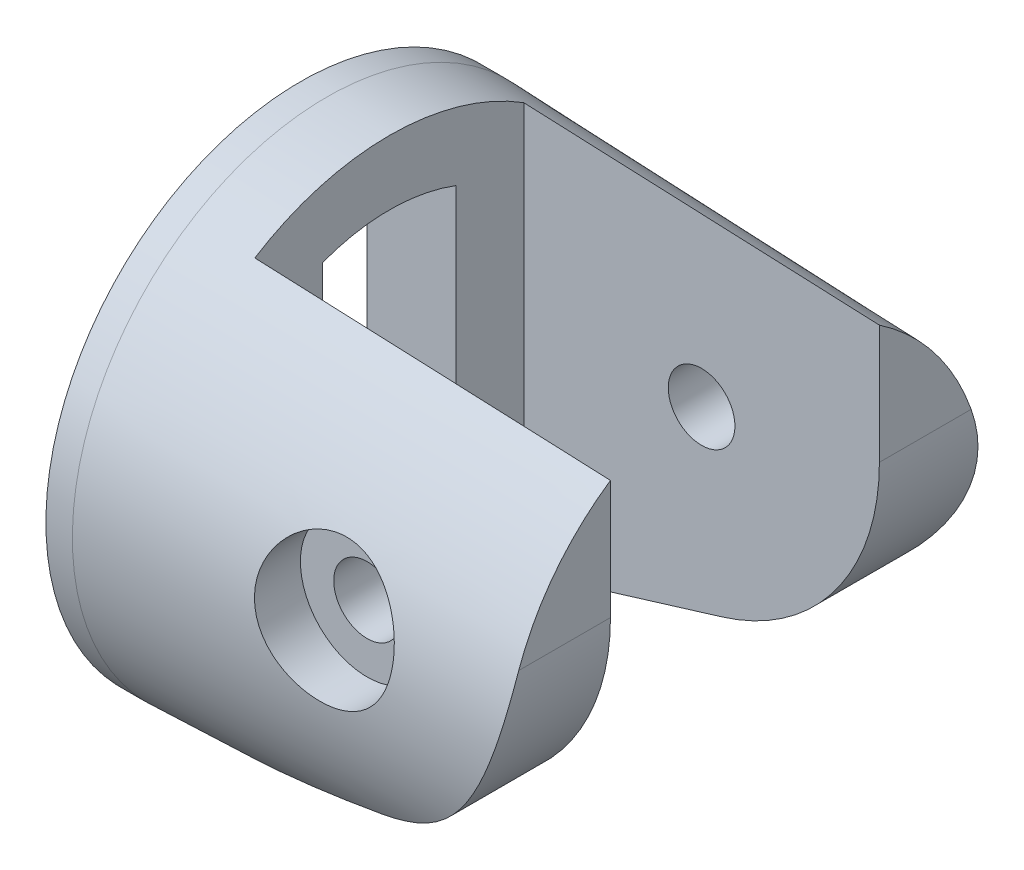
ISO-10303-21;
HEADER;
FILE_DESCRIPTION(('STEP AP214'),'2;1');
FILE_NAME('part.step','',(''),(''),'','','');
FILE_SCHEMA(('AUTOMOTIVE_DESIGN { 1 0 10303 214 1 1 1 1 }'));
ENDSEC;
DATA;
#1=APPLICATION_CONTEXT('core data for automotive mechanical design processes');
#2=APPLICATION_PROTOCOL_DEFINITION('international standard','automotive_design',2000,#1);
#3=PRODUCT_CONTEXT('',#1,'mechanical');
#4=PRODUCT('Part','Part','',(#3));
#5=PRODUCT_RELATED_PRODUCT_CATEGORY('part','',(#4));
#6=PRODUCT_DEFINITION_FORMATION('','',#4);
#7=PRODUCT_DEFINITION_CONTEXT('part definition',#1,'design');
#8=PRODUCT_DEFINITION('design','',#6,#7);
#9=PRODUCT_DEFINITION_SHAPE('','',#8);
#10=(LENGTH_UNIT() NAMED_UNIT(*) SI_UNIT(.MILLI.,.METRE.));
#11=(NAMED_UNIT(*) PLANE_ANGLE_UNIT() SI_UNIT($,.RADIAN.));
#12=(NAMED_UNIT(*) SI_UNIT($,.STERADIAN.) SOLID_ANGLE_UNIT());
#13=UNCERTAINTY_MEASURE_WITH_UNIT(LENGTH_MEASURE(1.E-05),#10,'distance_accuracy_value','');
#14=(GEOMETRIC_REPRESENTATION_CONTEXT(3) GLOBAL_UNCERTAINTY_ASSIGNED_CONTEXT((#13)) GLOBAL_UNIT_ASSIGNED_CONTEXT((#10,
#11,#12)) REPRESENTATION_CONTEXT('',''));
#15=CARTESIAN_POINT('',(0.,0.,0.));
#16=DIRECTION('',(0.,0.,1.));
#17=DIRECTION('',(1.,0.,0.));
#18=AXIS2_PLACEMENT_3D('',#15,#16,#17);
#19=CARTESIAN_POINT('',(20.,0.,0.));
#20=DIRECTION('',(-1.,0.,0.));
#21=DIRECTION('',(0.,0.,1.));
#22=AXIS2_PLACEMENT_3D('',#19,#20,#21);
#23=CYLINDRICAL_SURFACE('',#22,11.45);
#24=CARTESIAN_POINT('',(0.,0.,0.));
#25=DIRECTION('',(-1.,0.,0.));
#26=DIRECTION('',(0.,0.,1.));
#27=AXIS2_PLACEMENT_3D('',#24,#25,#26);
#28=CIRCLE('',#27,11.45);
#29=CARTESIAN_POINT('',(0.,-9.92134659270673,5.71571358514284));
#30=VERTEX_POINT('',#29);
#31=CARTESIAN_POINT('',(0.,-9.92134659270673,-5.71571358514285));
#32=VERTEX_POINT('',#31);
#33=EDGE_CURVE('E49',#30,#32,#28,.T.);
#34=ORIENTED_EDGE('',*,*,#33,.F.);
#35=CARTESIAN_POINT('',(32.4512624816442,0.,0.));
#36=DIRECTION('',(-0.292371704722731,0.956304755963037,0.));
#37=DIRECTION('',(-0.956304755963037,-0.292371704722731,0.));
#38=AXIS2_PLACEMENT_3D('',#35,#36,#37);
#39=ELLIPSE('',#38,39.1624764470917,11.45);
#40=CARTESIAN_POINT('',(1.19109025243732,-9.55719375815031,6.30575510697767));
#41=VERTEX_POINT('',#40);
#42=EDGE_CURVE('E344',#30,#41,#39,.T.);
#43=ORIENTED_EDGE('',*,*,#42,.T.);
#44=CARTESIAN_POINT('',(1.19109025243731,0.,0.));
#45=DIRECTION('',(-1.,0.,0.));
#46=DIRECTION('',(0.,0.,1.));
#47=AXIS2_PLACEMENT_3D('',#44,#45,#46);
#48=CIRCLE('',#47,11.4500000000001);
#49=CARTESIAN_POINT('',(1.19109025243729,-9.55719375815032,-6.30575510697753));
#50=VERTEX_POINT('',#49);
#51=EDGE_CURVE('E233',#41,#50,#48,.T.);
#52=ORIENTED_EDGE('',*,*,#51,.T.);
#53=EDGE_CURVE('E347',#50,#32,#39,.T.);
#54=ORIENTED_EDGE('',*,*,#53,.T.);
#55=EDGE_LOOP('',(#34,#43,#52,#54));
#56=FACE_BOUND('',#55,.T.);
#57=ADVANCED_FACE('F36',(#56),#23,.T.);
#58=CARTESIAN_POINT('',(12.9237170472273,-5.97016977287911,-11.45));
#59=DIRECTION('',(-0.292371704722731,0.956304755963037,0.));
#60=DIRECTION('',(-0.956304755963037,-0.292371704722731,0.));
#61=AXIS2_PLACEMENT_3D('',#58,#59,#60);
#62=PLANE('',#61);
#63=DIRECTION('',(0.,0.,1.));
#64=VECTOR('',#63,1.);
#65=CARTESIAN_POINT('',(0.,-9.92134659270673,-11.45));
#66=LINE('',#65,#64);
#67=EDGE_CURVE('E348',#32,#30,#66,.T.);
#68=ORIENTED_EDGE('',*,*,#67,.F.);
#69=ORIENTED_EDGE('',*,*,#53,.F.);
#70=CARTESIAN_POINT('',(28.5302298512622,-1.19877997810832,0.));
#71=DIRECTION('',(-0.292371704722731,0.956304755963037,0.));
#72=DIRECTION('',(-0.956304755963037,-0.292371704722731,0.));
#73=AXIS2_PLACEMENT_3D('',#70,#71,#72);
#74=ELLIPSE('',#73,35.8970996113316,10.4266087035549);
#75=CARTESIAN_POINT('',(12.9237170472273,-5.97016977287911,-9.28681991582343));
#76=VERTEX_POINT('',#75);
#77=EDGE_CURVE('E378',#76,#50,#74,.T.);
#78=ORIENTED_EDGE('',*,*,#77,.F.);
#79=DIRECTION('',(0.,0.,1.));
#80=VECTOR('',#79,1.);
#81=CARTESIAN_POINT('',(12.9237170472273,-5.97016977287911,-11.45));
#82=LINE('',#81,#80);
#83=CARTESIAN_POINT('',(12.9237170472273,-5.97016977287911,-6.05));
#84=VERTEX_POINT('',#83);
#85=EDGE_CURVE('E410',#76,#84,#82,.T.);
#86=ORIENTED_EDGE('',*,*,#85,.T.);
#87=DIRECTION('',(0.956304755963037,0.292371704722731,0.));
#88=VECTOR('',#87,1.);
#89=CARTESIAN_POINT('',(17.8629696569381,-4.46008870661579,-6.05));
#90=LINE('',#89,#88);
#91=CARTESIAN_POINT('',(3.99999999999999,-8.69842386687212,-6.05));
#92=VERTEX_POINT('',#91);
#93=EDGE_CURVE('E373',#92,#84,#90,.T.);
#94=ORIENTED_EDGE('',*,*,#93,.F.);
#95=DIRECTION('',(0.,0.,-1.));
#96=VECTOR('',#95,1.);
#97=CARTESIAN_POINT('',(4.,-8.69842386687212,-6.05));
#98=LINE('',#97,#96);
#99=CARTESIAN_POINT('',(4.,-8.69842386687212,6.05));
#100=VERTEX_POINT('',#99);
#101=EDGE_CURVE('E356',#100,#92,#98,.T.);
#102=ORIENTED_EDGE('',*,*,#101,.F.);
#103=DIRECTION('',(-0.956304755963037,-0.292371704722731,0.));
#104=VECTOR('',#103,1.);
#105=CARTESIAN_POINT('',(17.8629696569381,-4.46008870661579,6.05));
#106=LINE('',#105,#104);
#107=CARTESIAN_POINT('',(12.9237170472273,-5.97016977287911,6.05));
#108=VERTEX_POINT('',#107);
#109=EDGE_CURVE('E352',#108,#100,#106,.T.);
#110=ORIENTED_EDGE('',*,*,#109,.F.);
#111=CARTESIAN_POINT('',(12.9237170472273,-5.97016977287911,9.28681991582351));
#112=VERTEX_POINT('',#111);
#113=EDGE_CURVE('E411',#108,#112,#82,.T.);
#114=ORIENTED_EDGE('',*,*,#113,.T.);
#115=EDGE_CURVE('E244',#41,#112,#74,.T.);
#116=ORIENTED_EDGE('',*,*,#115,.F.);
#117=ORIENTED_EDGE('',*,*,#42,.F.);
#118=EDGE_LOOP('',(#68,#69,#78,#86,#94,#102,#110,#114,#116,#117));
#119=FACE_BOUND('',#118,.T.);
#120=ADVANCED_FACE('F335',(#119),#62,.F.);
#121=CARTESIAN_POINT('',(-25.,-7.,-3.));
#122=DIRECTION('',(0.,-1.,0.));
#123=DIRECTION('',(0.,0.,-1.));
#124=AXIS2_PLACEMENT_3D('',#121,#122,#123);
#125=PLANE('',#124);
#126=DIRECTION('',(0.,0.,-1.));
#127=VECTOR('',#126,1.);
#128=CARTESIAN_POINT('',(0.,-7.,-3.));
#129=LINE('',#128,#127);
#130=CARTESIAN_POINT('',(0.,-7.,3.));
#131=VERTEX_POINT('',#130);
#132=CARTESIAN_POINT('',(0.,-7.,-3.));
#133=VERTEX_POINT('',#132);
#134=EDGE_CURVE('E164',#131,#133,#129,.T.);
#135=ORIENTED_EDGE('',*,*,#134,.F.);
#136=DIRECTION('',(1.,0.,0.));
#137=VECTOR('',#136,1.);
#138=CARTESIAN_POINT('',(-25.,-7.,3.));
#139=LINE('',#138,#137);
#140=CARTESIAN_POINT('',(4.,-7.,3.));
#141=VERTEX_POINT('',#140);
#142=EDGE_CURVE('E173',#131,#141,#139,.T.);
#143=ORIENTED_EDGE('',*,*,#142,.T.);
#144=DIRECTION('',(0.,0.,1.));
#145=VECTOR('',#144,1.);
#146=CARTESIAN_POINT('',(4.,-7.,-6.05));
#147=LINE('',#146,#145);
#148=CARTESIAN_POINT('',(4.,-7.,-3.));
#149=VERTEX_POINT('',#148);
#150=EDGE_CURVE('E196',#149,#141,#147,.T.);
#151=ORIENTED_EDGE('',*,*,#150,.F.);
#152=DIRECTION('',(1.,0.,0.));
#153=VECTOR('',#152,1.);
#154=CARTESIAN_POINT('',(-25.,-7.,-3.));
#155=LINE('',#154,#153);
#156=EDGE_CURVE('E175',#133,#149,#155,.T.);
#157=ORIENTED_EDGE('',*,*,#156,.F.);
#158=EDGE_LOOP('',(#135,#143,#151,#157));
#159=FACE_BOUND('',#158,.T.);
#160=ADVANCED_FACE('F171',(#159),#125,.F.);
#161=CARTESIAN_POINT('',(-25.,0.,0.));
#162=DIRECTION('',(1.,0.,0.));
#163=DIRECTION('',(0.,0.,-1.));
#164=AXIS2_PLACEMENT_3D('',#161,#162,#163);
#165=CYLINDRICAL_SURFACE('',#164,8.45);
#166=CARTESIAN_POINT('',(0.,0.,0.));
#167=DIRECTION('',(-1.,0.,0.));
#168=DIRECTION('',(0.,0.,1.));
#169=AXIS2_PLACEMENT_3D('',#166,#167,#168);
#170=CIRCLE('',#169,8.45);
#171=CARTESIAN_POINT('',(0.,7.8995253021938,-3.));
#172=VERTEX_POINT('',#171);
#173=CARTESIAN_POINT('',(0.,7.8995253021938,2.99999999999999));
#174=VERTEX_POINT('',#173);
#175=EDGE_CURVE('E56',#172,#174,#170,.F.);
#176=ORIENTED_EDGE('',*,*,#175,.F.);
#177=DIRECTION('',(1.,0.,0.));
#178=VECTOR('',#177,1.);
#179=CARTESIAN_POINT('',(-25.,7.8995253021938,-3.));
#180=LINE('',#179,#178);
#181=CARTESIAN_POINT('',(4.,7.8995253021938,-3.));
#182=VERTEX_POINT('',#181);
#183=EDGE_CURVE('E184',#172,#182,#180,.T.);
#184=ORIENTED_EDGE('',*,*,#183,.T.);
#185=CARTESIAN_POINT('',(4.,0.,0.));
#186=DIRECTION('',(-1.,0.,0.));
#187=DIRECTION('',(0.,0.,1.));
#188=AXIS2_PLACEMENT_3D('',#185,#186,#187);
#189=CIRCLE('',#188,8.45);
#190=CARTESIAN_POINT('',(4.,7.8995253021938,2.99999999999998));
#191=VERTEX_POINT('',#190);
#192=EDGE_CURVE('E193',#191,#182,#189,.T.);
#193=ORIENTED_EDGE('',*,*,#192,.F.);
#194=DIRECTION('',(1.,0.,0.));
#195=VECTOR('',#194,1.);
#196=CARTESIAN_POINT('',(-25.,7.8995253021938,2.99999999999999));
#197=LINE('',#196,#195);
#198=EDGE_CURVE('E182',#174,#191,#197,.T.);
#199=ORIENTED_EDGE('',*,*,#198,.F.);
#200=EDGE_LOOP('',(#176,#184,#193,#199));
#201=FACE_BOUND('',#200,.T.);
#202=ADVANCED_FACE('F459',(#201),#165,.F.);
#203=CARTESIAN_POINT('',(-25.,-7.,-3.));
#204=DIRECTION('',(0.,0.,-1.));
#205=DIRECTION('',(0.,1.,0.));
#206=AXIS2_PLACEMENT_3D('',#203,#204,#205);
#207=PLANE('',#206);
#208=DIRECTION('',(0.,1.,0.));
#209=VECTOR('',#208,1.);
#210=CARTESIAN_POINT('',(0.,-7.,-3.));
#211=LINE('',#210,#209);
#212=EDGE_CURVE('E176',#133,#172,#211,.T.);
#213=ORIENTED_EDGE('',*,*,#212,.F.);
#214=ORIENTED_EDGE('',*,*,#156,.T.);
#215=DIRECTION('',(0.,-1.,0.));
#216=VECTOR('',#215,1.);
#217=CARTESIAN_POINT('',(4.,-11.45,-3.));
#218=LINE('',#217,#216);
#219=EDGE_CURVE('E190',#182,#149,#218,.T.);
#220=ORIENTED_EDGE('',*,*,#219,.F.);
#221=ORIENTED_EDGE('',*,*,#183,.F.);
#222=EDGE_LOOP('',(#213,#214,#220,#221));
#223=FACE_BOUND('',#222,.T.);
#224=ADVANCED_FACE('F509',(#223),#207,.F.);
#225=CARTESIAN_POINT('',(-25.,2.24266385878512,2.99999999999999));
#226=DIRECTION('',(0.,0.,1.));
#227=DIRECTION('',(0.,-1.,0.));
#228=AXIS2_PLACEMENT_3D('',#225,#226,#227);
#229=PLANE('',#228);
#230=DIRECTION('',(0.,-1.,0.));
#231=VECTOR('',#230,1.);
#232=CARTESIAN_POINT('',(0.,2.24266385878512,2.99999999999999));
#233=LINE('',#232,#231);
#234=EDGE_CURVE('E12',#174,#131,#233,.T.);
#235=ORIENTED_EDGE('',*,*,#234,.F.);
#236=ORIENTED_EDGE('',*,*,#198,.T.);
#237=DIRECTION('',(0.,1.,0.));
#238=VECTOR('',#237,1.);
#239=CARTESIAN_POINT('',(4.,-11.45,3.00000000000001));
#240=LINE('',#239,#238);
#241=EDGE_CURVE('E180',#141,#191,#240,.T.);
#242=ORIENTED_EDGE('',*,*,#241,.F.);
#243=ORIENTED_EDGE('',*,*,#142,.F.);
#244=EDGE_LOOP('',(#235,#236,#242,#243));
#245=FACE_BOUND('',#244,.T.);
#246=ADVANCED_FACE('F178',(#245),#229,.F.);
#247=CARTESIAN_POINT('',(12.,1.7520510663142,-11.45));
#248=DIRECTION('',(0.,0.,1.));
#249=DIRECTION('',(1.,0.,0.));
#250=AXIS2_PLACEMENT_3D('',#247,#248,#249);
#251=CYLINDRICAL_SURFACE('',#250,1.5);
#252=CARTESIAN_POINT('',(12.,1.7520510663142,6.05));
#253=DIRECTION('',(0.,0.,1.));
#254=DIRECTION('',(1.,0.,0.));
#255=AXIS2_PLACEMENT_3D('',#252,#253,#254);
#256=CIRCLE('',#255,1.5);
#257=CARTESIAN_POINT('',(13.5,1.7520510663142,6.05));
#258=VERTEX_POINT('',#257);
#259=EDGE_CURVE('E377',#258,#258,#256,.T.);
#260=ORIENTED_EDGE('',*,*,#259,.F.);
#261=EDGE_LOOP('',(#260));
#262=FACE_BOUND('',#261,.T.);
#263=CARTESIAN_POINT('',(12.,1.7520510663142,9.));
#264=DIRECTION('',(0.,0.,1.));
#265=DIRECTION('',(1.,0.,0.));
#266=AXIS2_PLACEMENT_3D('',#263,#264,#265);
#267=CIRCLE('',#266,1.5);
#268=CARTESIAN_POINT('',(13.5,1.7520510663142,9.));
#269=VERTEX_POINT('',#268);
#270=EDGE_CURVE('E237',#269,#269,#267,.F.);
#271=ORIENTED_EDGE('',*,*,#270,.F.);
#272=EDGE_LOOP('',(#271));
#273=FACE_BOUND('',#272,.T.);
#274=ADVANCED_FACE('F256',(#262,#273),#251,.F.);
#275=CARTESIAN_POINT('',(1.19109025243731,0.,0.));
#276=DIRECTION('',(-1.,0.,0.));
#277=DIRECTION('',(0.,0.,1.));
#278=AXIS2_PLACEMENT_3D('',#275,#276,#277);
#279=CONICAL_SURFACE('',#278,11.4500000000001,0.0349065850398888);
#280=CARTESIAN_POINT('',(7.39359152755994,-0.22648244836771,0.));
#281=DIRECTION('',(-0.866025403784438,0.5,0.));
#282=DIRECTION('',(-0.5,-0.866025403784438,0.));
#283=AXIS2_PLACEMENT_3D('',#280,#281,#282);
#284=ELLIPSE('',#283,12.9712175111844,11.2311205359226);
#285=CARTESIAN_POINT('',(8.53589838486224,1.7520510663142,-11.0555445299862));
#286=VERTEX_POINT('',#285);
#287=CARTESIAN_POINT('',(10.2679491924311,4.75205106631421,-10.067886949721));
#288=VERTEX_POINT('',#287);
#289=EDGE_CURVE('E43',#286,#288,#284,.F.);
#290=ORIENTED_EDGE('',*,*,#289,.F.);
#291=CARTESIAN_POINT('',(9.41750853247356,0.225057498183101,0.));
#292=DIRECTION('',(-0.866025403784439,-0.5,0.));
#293=DIRECTION('',(-0.5,0.866025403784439,0.));
#294=AXIS2_PLACEMENT_3D('',#291,#292,#293);
#295=ELLIPSE('',#294,12.8896070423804,11.1604581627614);
#296=CARTESIAN_POINT('',(10.2679491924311,-1.24794893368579,-11.0628640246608));
#297=VERTEX_POINT('',#296);
#298=EDGE_CURVE('E303',#297,#286,#295,.F.);
#299=ORIENTED_EDGE('',*,*,#298,.F.);
#300=CARTESIAN_POINT('',(18.8361083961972,-1.2479489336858,-10.7617066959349));
#301=CARTESIAN_POINT('',(16.1268527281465,-1.2479489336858,-10.8569491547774));
#302=CARTESIAN_POINT('',(13.4175965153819,-1.24794893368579,-10.9521761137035));
#303=CARTESIAN_POINT('',(7.99908300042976,-1.24794893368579,-11.1425990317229));
#304=CARTESIAN_POINT('',(5.28982569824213,-1.24794893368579,-11.2377949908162));
#305=CARTESIAN_POINT('',(2.58056785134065,-1.24794893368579,-11.3329754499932));
#306=B_SPLINE_CURVE_WITH_KNOTS('',3,(#300,#301,#302,#303,#304,#305),.UNSPECIFIED.,.F.,.F.,(4,2,
4),(0.,8.13278775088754,16.2655755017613),.UNSPECIFIED.);
#307=CARTESIAN_POINT('',(13.7320508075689,-1.24794893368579,-10.9411191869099));
#308=VERTEX_POINT('',#307);
#309=EDGE_CURVE('E294',#308,#297,#306,.T.);
#310=ORIENTED_EDGE('',*,*,#309,.F.);
#311=CARTESIAN_POINT('',(14.3246121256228,-0.221602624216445,0.));
#312=DIRECTION('',(0.866025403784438,-0.5,0.));
#313=DIRECTION('',(-0.5,-0.866025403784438,0.));
#314=AXIS2_PLACEMENT_3D('',#311,#312,#313);
#315=ELLIPSE('',#314,12.6917377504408,10.9891331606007);
#316=CARTESIAN_POINT('',(15.4641016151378,1.75205106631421,-10.8105190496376));
#317=VERTEX_POINT('',#316);
#318=EDGE_CURVE('E302',#317,#308,#315,.F.);
#319=ORIENTED_EDGE('',*,*,#318,.F.);
#320=CARTESIAN_POINT('',(16.3485291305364,0.220177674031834,0.));
#321=DIRECTION('',(0.866025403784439,0.5,0.));
#322=DIRECTION('',(-0.5,0.866025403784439,0.));
#323=AXIS2_PLACEMENT_3D('',#320,#321,#322);
#324=ELLIPSE('',#323,12.6101272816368,10.9184707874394);
#325=CARTESIAN_POINT('',(13.7320508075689,4.75205106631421,-9.93395572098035));
#326=VERTEX_POINT('',#325);
#327=EDGE_CURVE('E469',#326,#317,#324,.F.);
#328=ORIENTED_EDGE('',*,*,#327,.F.);
#329=CARTESIAN_POINT('',(2.59126262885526,4.75205106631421,-10.3635516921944));
#330=CARTESIAN_POINT('',(5.30019437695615,4.75205106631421,-10.2595010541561));
#331=CARTESIAN_POINT('',(8.00911459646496,4.75205106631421,-10.1551519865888));
#332=CARTESIAN_POINT('',(13.4269319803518,4.75205106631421,-9.94585699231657));
#333=CARTESIAN_POINT('',(16.1358291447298,4.75205106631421,-9.84091106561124));
#334=CARTESIAN_POINT('',(18.8447147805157,4.75205106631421,-9.73566670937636));
#335=B_SPLINE_CURVE_WITH_KNOTS('',3,(#329,#330,#331,#332,#333,#334),.UNSPECIFIED.,.F.,.F.,(4,2,
4),(0.,8.13278779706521,16.2655756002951),.UNSPECIFIED.);
#336=EDGE_CURVE('E465',#288,#326,#335,.T.);
#337=ORIENTED_EDGE('',*,*,#336,.F.);
#338=EDGE_LOOP('',(#290,#299,#310,#319,#328,#337));
#339=FACE_BOUND('',#338,.T.);
#340=ORIENTED_EDGE('',*,*,#77,.T.);
#341=ORIENTED_EDGE('',*,*,#51,.F.);
#342=ORIENTED_EDGE('',*,*,#115,.T.);
#343=CARTESIAN_POINT('',(12.9235170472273,-5.97023091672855,9.28678891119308));
#344=CARTESIAN_POINT('',(13.1963528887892,-5.88679912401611,9.32905353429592));
#345=CARTESIAN_POINT('',(13.4644475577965,-5.79209295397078,9.37745471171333));
#346=CARTESIAN_POINT('',(13.9899025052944,-5.58104866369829,9.48331175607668));
#347=CARTESIAN_POINT('',(14.2472709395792,-5.46472736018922,9.54076057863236));
#348=CARTESIAN_POINT('',(15.0028989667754,-5.08405796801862,9.72218174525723));
#349=CARTESIAN_POINT('',(15.4837385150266,-4.78829613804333,9.85506210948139));
#350=CARTESIAN_POINT('',(16.1620315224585,-4.28801199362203,10.0523087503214));
#351=CARTESIAN_POINT('',(16.3809065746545,-4.11187412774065,10.1176919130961));
#352=CARTESIAN_POINT('',(16.8037450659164,-3.74115220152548,10.2448326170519));
#353=CARTESIAN_POINT('',(17.0077086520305,-3.54656832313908,10.3065901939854));
#354=CARTESIAN_POINT('',(17.3990425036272,-3.14014961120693,10.4233222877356));
#355=CARTESIAN_POINT('',(17.5864393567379,-2.92834350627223,10.4783077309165));
#356=CARTESIAN_POINT('',(17.9435885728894,-2.48821152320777,10.5786420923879));
#357=CARTESIAN_POINT('',(18.11334505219,-2.25988952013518,10.6239932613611));
#358=CARTESIAN_POINT('',(18.4018744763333,-1.83490042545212,10.6944091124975));
#359=CARTESIAN_POINT('',(18.5240835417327,-1.64092939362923,10.7217130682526));
#360=CARTESIAN_POINT('',(18.7552917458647,-1.24422311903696,10.7668280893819));
#361=CARTESIAN_POINT('',(18.8642934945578,-1.04148961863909,10.7846410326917));
#362=CARTESIAN_POINT('',(19.0682631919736,-0.628454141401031,10.8094375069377));
#363=CARTESIAN_POINT('',(19.1632329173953,-0.418153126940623,10.8164224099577));
#364=CARTESIAN_POINT('',(19.338414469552,0.0085782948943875,10.8183814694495));
#365=CARTESIAN_POINT('',(19.4186266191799,0.22500856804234,10.8133558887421));
#366=CARTESIAN_POINT('',(19.5640975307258,0.663431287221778,10.7902643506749));
#367=CARTESIAN_POINT('',(19.6292759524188,0.885446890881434,10.7721303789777));
#368=CARTESIAN_POINT('',(19.7438045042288,1.33203397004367,10.7220366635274));
#369=CARTESIAN_POINT('',(19.7931522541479,1.55660582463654,10.6900748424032));
#370=CARTESIAN_POINT('',(19.8759030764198,2.00585532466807,10.6120082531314));
#371=CARTESIAN_POINT('',(19.9093301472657,2.23053229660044,10.5659249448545));
#372=CARTESIAN_POINT('',(19.96062425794,2.67818309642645,10.4595689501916));
#373=CARTESIAN_POINT('',(19.978501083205,2.90115790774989,10.3993052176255));
#374=CARTESIAN_POINT('',(19.9926452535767,3.20131999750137,10.3080859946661));
#375=CARTESIAN_POINT('',(19.9954169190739,3.28011948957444,10.2831809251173));
#376=CARTESIAN_POINT('',(19.999093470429,3.43706984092,10.2316537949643));
#377=CARTESIAN_POINT('',(20.0000011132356,3.51522148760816,10.2050343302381));
#378=CARTESIAN_POINT('',(19.999999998,3.59307778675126,10.1775484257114));
#379=B_SPLINE_CURVE_WITH_KNOTS('',3,(#343,#344,#345,#346,#347,#348,#349,#350,#351,#352,#353,
#354,#355,#356,#357,#358,#359,#360,#361,#362,#363,#364,#365,#366,#367,#368,#369,#370,#371,#372,
#373,#374,#375,#376,#377,#378),.UNSPECIFIED.,.F.,.F.,(4,2,2,2,2,2,2,2,2,2,2,2,2,2,2,2,2,4),(0.,
0.864373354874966,1.72807701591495,3.4584482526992,4.32309476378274,5.18773274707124,
6.05095689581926,6.91397916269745,7.60593816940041,8.29776021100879,8.9894945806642,
9.68121381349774,10.3765481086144,11.0719869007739,11.7663740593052,12.460323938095,
12.7083573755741,12.9560236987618),.UNSPECIFIED.);
#380=CARTESIAN_POINT('',(20.,3.59287778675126,10.1776190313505));
#381=VERTEX_POINT('',#380);
#382=EDGE_CURVE('E236',#112,#381,#379,.T.);
#383=ORIENTED_EDGE('',*,*,#382,.T.);
#384=CARTESIAN_POINT('',(20.,0.,0.));
#385=DIRECTION('',(1.,0.,0.));
#386=DIRECTION('',(0.,0.,-1.));
#387=AXIS2_PLACEMENT_3D('',#384,#385,#386);
#388=CIRCLE('',#387,10.7931783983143);
#389=CARTESIAN_POINT('',(20.,8.93813179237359,6.05));
#390=VERTEX_POINT('',#389);
#391=EDGE_CURVE('E386',#390,#381,#388,.T.);
#392=ORIENTED_EDGE('',*,*,#391,.F.);
#393=CARTESIAN_POINT('',(27.8719974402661,8.60417109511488,6.05));
#394=CARTESIAN_POINT('',(24.2424924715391,8.75909873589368,6.05));
#395=CARTESIAN_POINT('',(20.6129299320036,8.91267189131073,6.05));
#396=CARTESIAN_POINT('',(13.3537064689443,9.21744768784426,6.05));
#397=CARTESIAN_POINT('',(9.72404554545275,9.36865032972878,6.05));
#398=CARTESIAN_POINT('',(2.46464002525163,9.66902364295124,6.05));
#399=CARTESIAN_POINT('',(-1.16510457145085,9.81819431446,6.05));
#400=CARTESIAN_POINT('',(-8.42466779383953,10.114752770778,6.05));
#401=CARTESIAN_POINT('',(-12.0544864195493,10.2621405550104,6.05));
#402=CARTESIAN_POINT('',(-15.6843359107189,10.4087613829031,6.05));
#403=B_SPLINE_CURVE_WITH_KNOTS('',3,(#393,#394,#395,#396,#397,#398,#399,#400,#401,#402),
.UNSPECIFIED.,.F.,.F.,(4,2,2,2,4),(0.,10.8984295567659,21.7968555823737,32.6952806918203,
43.5937093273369),.UNSPECIFIED.);
#404=CARTESIAN_POINT('',(4.,9.60538269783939,6.05));
#405=VERTEX_POINT('',#404);
#406=EDGE_CURVE('E274',#390,#405,#403,.T.);
#407=ORIENTED_EDGE('',*,*,#406,.T.);
#408=CARTESIAN_POINT('',(4.,0.,0.));
#409=DIRECTION('',(-1.,0.,0.));
#410=DIRECTION('',(0.,0.,1.));
#411=AXIS2_PLACEMENT_3D('',#408,#409,#410);
#412=CIRCLE('',#411,11.3519107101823);
#413=CARTESIAN_POINT('',(4.,9.60538269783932,-6.05));
#414=VERTEX_POINT('',#413);
#415=EDGE_CURVE('E393',#405,#414,#412,.T.);
#416=ORIENTED_EDGE('',*,*,#415,.T.);
#417=CARTESIAN_POINT('',(-15.6843359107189,10.408761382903,-6.04999999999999));
#418=CARTESIAN_POINT('',(-12.0544864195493,10.2621405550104,-6.04999999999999));
#419=CARTESIAN_POINT('',(-8.42466779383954,10.114752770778,-6.04999999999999));
#420=CARTESIAN_POINT('',(-1.16510457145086,9.81819431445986,-6.05));
#421=CARTESIAN_POINT('',(2.46464002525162,9.66902364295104,-6.05));
#422=CARTESIAN_POINT('',(9.72404554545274,9.36865032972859,-6.05));
#423=CARTESIAN_POINT('',(13.3537064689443,9.21744768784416,-6.05));
#424=CARTESIAN_POINT('',(20.6129299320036,8.91267189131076,-6.05));
#425=CARTESIAN_POINT('',(24.2424924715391,8.75909873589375,-6.05));
#426=CARTESIAN_POINT('',(27.8719974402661,8.60417109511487,-6.05));
#427=B_SPLINE_CURVE_WITH_KNOTS('',3,(#417,#418,#419,#420,#421,#422,#423,#424,#425,#426),
.UNSPECIFIED.,.F.,.F.,(4,2,2,2,4),(0.,10.8984286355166,21.7968537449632,32.6952797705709,
43.5937093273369),.UNSPECIFIED.);
#428=CARTESIAN_POINT('',(20.,8.93813179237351,-6.05));
#429=VERTEX_POINT('',#428);
#430=EDGE_CURVE('E281',#414,#429,#427,.T.);
#431=ORIENTED_EDGE('',*,*,#430,.T.);
#432=CARTESIAN_POINT('',(20.,0.,0.));
#433=DIRECTION('',(1.,0.,0.));
#434=DIRECTION('',(0.,0.,-1.));
#435=AXIS2_PLACEMENT_3D('',#432,#433,#434);
#436=CIRCLE('',#435,10.7931783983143);
#437=CARTESIAN_POINT('',(20.,3.59287778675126,-10.1776190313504));
#438=VERTEX_POINT('',#437);
#439=EDGE_CURVE('E385',#438,#429,#436,.T.);
#440=ORIENTED_EDGE('',*,*,#439,.F.);
#441=CARTESIAN_POINT('',(19.999999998,3.59307778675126,-10.1775484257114));
#442=CARTESIAN_POINT('',(20.0000028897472,3.48853140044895,-10.2144585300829));
#443=CARTESIAN_POINT('',(19.9983642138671,3.38344555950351,-10.2498052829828));
#444=CARTESIAN_POINT('',(19.9917124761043,3.17236245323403,-10.317332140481));
#445=CARTESIAN_POINT('',(19.9866992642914,3.06636514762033,-10.3495121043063));
#446=CARTESIAN_POINT('',(19.9664639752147,2.7473158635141,-10.4412243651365));
#447=CARTESIAN_POINT('',(19.9460463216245,2.5331625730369,-10.4959445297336));
#448=CARTESIAN_POINT('',(19.8909958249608,2.10469983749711,-10.5921266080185));
#449=CARTESIAN_POINT('',(19.8564234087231,1.89039487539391,-10.6336435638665));
#450=CARTESIAN_POINT('',(19.7728713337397,1.46250433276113,-10.7038332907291));
#451=CARTESIAN_POINT('',(19.7238929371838,1.24891869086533,-10.7325071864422));
#452=CARTESIAN_POINT('',(19.6115455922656,0.824027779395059,-10.7774007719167));
#453=CARTESIAN_POINT('',(19.5481630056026,0.612724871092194,-10.7936085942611));
#454=CARTESIAN_POINT('',(19.407344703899,0.194259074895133,-10.8141587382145));
#455=CARTESIAN_POINT('',(19.3299078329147,-0.0129034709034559,-10.8185000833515));
#456=CARTESIAN_POINT('',(19.1614830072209,-0.421607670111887,-10.8161755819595));
#457=CARTESIAN_POINT('',(19.0704926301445,-0.623148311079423,-10.8095077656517));
#458=CARTESIAN_POINT('',(18.8756248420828,-1.01928209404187,-10.7862059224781));
#459=CARTESIAN_POINT('',(18.7717473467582,-1.21387519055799,-10.7695718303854));
#460=CARTESIAN_POINT('',(18.5499943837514,-1.59823283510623,-10.7271584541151));
#461=CARTESIAN_POINT('',(18.4319147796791,-1.7878631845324,-10.7012316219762));
#462=CARTESIAN_POINT('',(18.1839567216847,-2.15799452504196,-10.6416118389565));
#463=CARTESIAN_POINT('',(18.0540744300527,-2.33849251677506,-10.6079163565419));
#464=CARTESIAN_POINT('',(17.6476949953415,-2.86540457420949,-10.4971767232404));
#465=CARTESIAN_POINT('',(17.3545230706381,-3.19713711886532,-10.4104916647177));
#466=CARTESIAN_POINT('',(16.6765938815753,-3.86959695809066,-10.2069139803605));
#467=CARTESIAN_POINT('',(16.284736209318,-4.20231274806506,-10.087391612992));
#468=CARTESIAN_POINT('',(15.4552894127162,-4.80365176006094,-9.8474909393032));
#469=CARTESIAN_POINT('',(15.0177494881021,-5.07234293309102,-9.72711368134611));
#470=CARTESIAN_POINT('',(14.2995814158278,-5.4403733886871,-9.55267782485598));
#471=CARTESIAN_POINT('',(14.032178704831,-5.56291015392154,-9.4923254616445));
#472=CARTESIAN_POINT('',(13.4860422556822,-5.78444932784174,-9.38136131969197));
#473=CARTESIAN_POINT('',(13.2073143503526,-5.88346367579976,-9.33074460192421));
#474=CARTESIAN_POINT('',(12.9235170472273,-5.97023091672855,-9.28678891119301));
#475=B_SPLINE_CURVE_WITH_KNOTS('',3,(#441,#442,#443,#444,#445,#446,#447,#448,#449,#450,#451,
#452,#453,#454,#455,#456,#457,#458,#459,#460,#461,#462,#463,#464,#465,#466,#467,#468,#469,#470,
#471,#472,#473,#474),.UNSPECIFIED.,.F.,.F.,(4,2,2,2,2,2,2,2,2,2,2,2,2,2,2,2,4),(0.,
0.332562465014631,0.665139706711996,1.3301548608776,1.99236017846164,2.65450749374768,
3.31728438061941,3.98011580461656,4.64306583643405,5.30602020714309,5.98000442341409,
6.65420857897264,8.00296096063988,9.58039667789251,11.1561506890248,12.0557958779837,
12.9549834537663),.UNSPECIFIED.);
#476=EDGE_CURVE('E288',#438,#76,#475,.T.);
#477=ORIENTED_EDGE('',*,*,#476,.T.);
#478=EDGE_LOOP('',(#340,#341,#342,#383,#392,#407,#416,#431,#440,#477));
#479=FACE_BOUND('',#478,.T.);
#480=CARTESIAN_POINT('',(9.89095068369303,-0.38147086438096,11.1396636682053));
#481=CARTESIAN_POINT('',(9.7741919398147,-0.26604823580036,11.1476944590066));
#482=CARTESIAN_POINT('',(9.66684565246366,-0.140937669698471,11.1539250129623));
#483=CARTESIAN_POINT('',(9.47400003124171,0.125292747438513,11.1608440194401));
#484=CARTESIAN_POINT('',(9.38850333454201,0.266414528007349,11.1615318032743));
#485=CARTESIAN_POINT('',(9.24175274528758,0.56077702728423,11.155748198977));
#486=CARTESIAN_POINT('',(9.18051873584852,0.714027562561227,11.1492709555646));
#487=CARTESIAN_POINT('',(9.08407218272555,1.02795009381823,11.1280999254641));
#488=CARTESIAN_POINT('',(9.04885615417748,1.18862109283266,11.1134072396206));
#489=CARTESIAN_POINT('',(9.00540237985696,1.51039536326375,11.0757649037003));
#490=CARTESIAN_POINT('',(8.99681278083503,1.67146459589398,11.0529274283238));
#491=CARTESIAN_POINT('',(9.00529335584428,1.99160044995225,10.9994516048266));
#492=CARTESIAN_POINT('',(9.02236623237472,2.15066685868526,10.9688124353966));
#493=CARTESIAN_POINT('',(9.08166963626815,2.46591803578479,10.9001951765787));
#494=CARTESIAN_POINT('',(9.12441123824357,2.62197591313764,10.8620788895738));
#495=CARTESIAN_POINT('',(9.23374030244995,2.92407283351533,10.7807277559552));
#496=CARTESIAN_POINT('',(9.30033447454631,3.07010904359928,10.7374914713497));
#497=CARTESIAN_POINT('',(9.45994144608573,3.35724101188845,10.6454854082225));
#498=CARTESIAN_POINT('',(9.55427103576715,3.49754892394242,10.5965399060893));
#499=CARTESIAN_POINT('',(9.76504521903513,3.76037788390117,10.4983303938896));
#500=CARTESIAN_POINT('',(9.88149883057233,3.88289164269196,10.4490662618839));
#501=CARTESIAN_POINT('',(10.1391551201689,4.11173955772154,10.3515304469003));
#502=CARTESIAN_POINT('',(10.2811710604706,4.21721417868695,10.3033803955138));
#503=CARTESIAN_POINT('',(10.58318978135,4.40233193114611,10.2141758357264));
#504=CARTESIAN_POINT('',(10.7431878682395,4.48198178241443,10.1731194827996));
#505=CARTESIAN_POINT('',(11.0700492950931,4.6094385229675,10.1034442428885));
#506=CARTESIAN_POINT('',(11.2363529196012,4.65842877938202,10.0743802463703));
#507=CARTESIAN_POINT('',(11.5765714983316,4.72707213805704,10.0292276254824));
#508=CARTESIAN_POINT('',(11.7504797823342,4.74675043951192,10.0131278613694));
#509=CARTESIAN_POINT('',(12.0832669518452,4.75507006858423,9.99630875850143));
#510=CARTESIAN_POINT('',(12.242016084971,4.74646403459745,9.99428183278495));
#511=CARTESIAN_POINT('',(12.5558610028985,4.70435081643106,10.0020631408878));
#512=CARTESIAN_POINT('',(12.7109571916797,4.67084639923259,10.0118700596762));
#513=CARTESIAN_POINT('',(13.0080237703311,4.58174503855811,10.0415454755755));
#514=CARTESIAN_POINT('',(13.1502571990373,4.5269036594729,10.0610756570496));
#515=CARTESIAN_POINT('',(13.4237397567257,4.39702685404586,10.1080951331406));
#516=CARTESIAN_POINT('',(13.5549863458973,4.32198677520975,10.1355862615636));
#517=CARTESIAN_POINT('',(13.8115061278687,4.14868495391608,10.198123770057));
#518=CARTESIAN_POINT('',(13.9359181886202,4.04928057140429,10.2335303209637));
#519=CARTESIAN_POINT('',(14.1669771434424,3.83274914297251,10.3079734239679));
#520=CARTESIAN_POINT('',(14.2736168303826,3.71561494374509,10.3470114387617));
#521=CARTESIAN_POINT('',(14.4746496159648,3.45647253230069,10.4291728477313));
#522=CARTESIAN_POINT('',(14.5674299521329,3.31323480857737,10.4723767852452));
#523=CARTESIAN_POINT('',(14.7276030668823,3.01267974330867,10.5569460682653));
#524=CARTESIAN_POINT('',(14.7949921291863,2.85536034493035,10.5983111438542));
#525=CARTESIAN_POINT('',(14.9032275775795,2.5276512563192,10.6773704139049));
#526=CARTESIAN_POINT('',(14.9435825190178,2.35707937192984,10.7149865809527));
#527=CARTESIAN_POINT('',(14.9939991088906,2.01022866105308,10.7836468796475));
#528=CARTESIAN_POINT('',(15.0040691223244,1.83395142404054,10.8146928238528));
#529=CARTESIAN_POINT('',(14.9931711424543,1.48806195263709,10.8679613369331));
#530=CARTESIAN_POINT('',(14.9733979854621,1.31845782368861,10.8904807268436));
#531=CARTESIAN_POINT('',(14.9051030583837,0.98430110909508,10.9281454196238));
#532=CARTESIAN_POINT('',(14.8565866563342,0.819747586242,10.9432920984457));
#533=CARTESIAN_POINT('',(14.7340970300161,0.506216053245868,10.9664800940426));
#534=CARTESIAN_POINT('',(14.6610212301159,0.356902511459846,10.974740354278));
#535=CARTESIAN_POINT('',(14.4911295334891,0.0722455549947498,10.9862390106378));
#536=CARTESIAN_POINT('',(14.3943132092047,-0.0630976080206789,10.9894773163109));
#537=CARTESIAN_POINT('',(14.1794199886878,-0.316222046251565,10.992621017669));
#538=CARTESIAN_POINT('',(14.0612984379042,-0.433965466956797,10.9925193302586));
#539=CARTESIAN_POINT('',(13.8072084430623,-0.648287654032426,10.9908547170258));
#540=CARTESIAN_POINT('',(13.6712387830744,-0.744864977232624,10.989291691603));
#541=CARTESIAN_POINT('',(13.3833039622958,-0.915311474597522,10.9865101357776));
#542=CARTESIAN_POINT('',(13.2311521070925,-0.988865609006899,10.9852964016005));
#543=CARTESIAN_POINT('',(12.9166712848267,-1.10942948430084,10.9848157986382));
#544=CARTESIAN_POINT('',(12.7543426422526,-1.15644007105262,10.9855488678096));
#545=CARTESIAN_POINT('',(12.4241839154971,-1.22257560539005,10.9899871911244));
#546=CARTESIAN_POINT('',(12.2563553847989,-1.24170835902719,10.9936916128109));
#547=CARTESIAN_POINT('',(11.9199614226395,-1.25159831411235,11.0043931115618));
#548=CARTESIAN_POINT('',(11.7513959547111,-1.24235409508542,11.0113903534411));
#549=CARTESIAN_POINT('',(11.4188472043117,-1.19589211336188,11.0282128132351));
#550=CARTESIAN_POINT('',(11.2548515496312,-1.15875947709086,11.0380293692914));
#551=CARTESIAN_POINT('',(10.935474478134,-1.05772228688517,11.0593709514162));
#552=CARTESIAN_POINT('',(10.7800911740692,-0.993823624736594,11.0708956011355));
#553=CARTESIAN_POINT('',(10.4951183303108,-0.847700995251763,11.09297482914));
#554=CARTESIAN_POINT('',(10.364460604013,-0.767549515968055,11.1035267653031));
#555=CARTESIAN_POINT('',(10.1167932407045,-0.588227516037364,11.1231283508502));
#556=CARTESIAN_POINT('',(9.99978302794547,-0.489057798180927,11.1321780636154));
#557=CARTESIAN_POINT('',(9.89095068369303,-0.38147086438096,11.1396636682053));
#558=B_SPLINE_CURVE_WITH_KNOTS('',3,(#480,#481,#482,#483,#484,#485,#486,#487,#488,#489,#490,
#491,#492,#493,#494,#495,#496,#497,#498,#499,#500,#501,#502,#503,#504,#505,#506,#507,#508,#509,
#510,#511,#512,#513,#514,#515,#516,#517,#518,#519,#520,#521,#522,#523,#524,#525,#526,#527,#528,
#529,#530,#531,#532,#533,#534,#535,#536,#537,#538,#539,#540,#541,#542,#543,#544,#545,#546,#547,
#548,#549,#550,#551,#552,#553,#554,#555,#556,#557),.UNSPECIFIED.,.T.,.F.,(4,2,2,2,2,2,2,2,2,2,2,
2,2,2,2,2,2,2,2,2,2,2,2,2,2,2,2,2,2,2,2,2,2,2,2,2,2,2,4),(0.,0.49260077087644,0.985260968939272,
1.47832406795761,1.97132111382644,2.45777509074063,2.94428029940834,3.44080894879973,
3.93747738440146,4.46317966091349,4.98909667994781,5.5363799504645,6.08352069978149,
6.60797546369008,7.13197909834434,7.60655306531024,8.08107430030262,8.54013120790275,
8.9992939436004,9.48664035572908,9.97418392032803,10.4999031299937,11.0256992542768,
11.5608115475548,12.0957760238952,12.6098827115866,13.1238934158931,13.6208608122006,
14.1178371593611,14.615867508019,15.1139318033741,15.6185402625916,16.1231326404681,
16.6275837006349,17.1320600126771,17.6350026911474,18.1378347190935,18.5970136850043,
19.0561732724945),.UNSPECIFIED.);
#559=CARTESIAN_POINT('',(9.89095068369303,-0.38147086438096,11.1396636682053));
#560=VERTEX_POINT('',#559);
#561=EDGE_CURVE('E232',#560,#560,#558,.T.);
#562=ORIENTED_EDGE('',*,*,#561,.T.);
#563=EDGE_LOOP('',(#562));
#564=FACE_BOUND('',#563,.T.);
#565=ADVANCED_FACE('F250',(#339,#479,#564),#279,.T.);
#566=CARTESIAN_POINT('',(20.,0.,0.));
#567=DIRECTION('',(1.,0.,0.));
#568=DIRECTION('',(0.,0.,-1.));
#569=AXIS2_PLACEMENT_3D('',#566,#567,#568);
#570=PLANE('',#569);
#571=DIRECTION('',(0.,-1.,0.));
#572=VECTOR('',#571,1.);
#573=CARTESIAN_POINT('',(20.,0.,6.05));
#574=LINE('',#573,#572);
#575=CARTESIAN_POINT('',(20.,3.59287778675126,6.05));
#576=VERTEX_POINT('',#575);
#577=EDGE_CURVE('E368',#390,#576,#574,.T.);
#578=ORIENTED_EDGE('',*,*,#577,.F.);
#579=ORIENTED_EDGE('',*,*,#391,.T.);
#580=DIRECTION('',(0.,0.,1.));
#581=VECTOR('',#580,1.);
#582=CARTESIAN_POINT('',(20.,3.59287778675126,-11.45));
#583=LINE('',#582,#581);
#584=EDGE_CURVE('E382',#576,#381,#583,.T.);
#585=ORIENTED_EDGE('',*,*,#584,.F.);
#586=EDGE_LOOP('',(#578,#579,#585));
#587=FACE_BOUND('',#586,.T.);
#588=ADVANCED_FACE('F255',(#587),#570,.T.);
#589=CARTESIAN_POINT('',(20.,3.59287778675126,-6.05));
#590=VERTEX_POINT('',#589);
#591=EDGE_CURVE('E402',#438,#590,#583,.T.);
#592=ORIENTED_EDGE('',*,*,#591,.F.);
#593=ORIENTED_EDGE('',*,*,#439,.T.);
#594=DIRECTION('',(0.,1.,0.));
#595=VECTOR('',#594,1.);
#596=CARTESIAN_POINT('',(20.,0.,-6.05));
#597=LINE('',#596,#595);
#598=EDGE_CURVE('E363',#590,#429,#597,.T.);
#599=ORIENTED_EDGE('',*,*,#598,.F.);
#600=EDGE_LOOP('',(#592,#593,#599));
#601=FACE_BOUND('',#600,.T.);
#602=ADVANCED_FACE('F401',(#601),#570,.T.);
#603=CARTESIAN_POINT('',(4.,-11.45,-6.05));
#604=DIRECTION('',(-1.,0.,0.));
#605=DIRECTION('',(0.,0.,1.));
#606=AXIS2_PLACEMENT_3D('',#603,#604,#605);
#607=PLANE('',#606);
#608=ORIENTED_EDGE('',*,*,#241,.T.);
#609=ORIENTED_EDGE('',*,*,#192,.T.);
#610=ORIENTED_EDGE('',*,*,#219,.T.);
#611=ORIENTED_EDGE('',*,*,#150,.T.);
#612=EDGE_LOOP('',(#608,#609,#610,#611));
#613=FACE_BOUND('',#612,.T.);
#614=ORIENTED_EDGE('',*,*,#415,.F.);
#615=DIRECTION('',(0.,1.,0.));
#616=VECTOR('',#615,1.);
#617=CARTESIAN_POINT('',(4.,-11.45,6.05));
#618=LINE('',#617,#616);
#619=EDGE_CURVE('E360',#100,#405,#618,.T.);
#620=ORIENTED_EDGE('',*,*,#619,.F.);
#621=ORIENTED_EDGE('',*,*,#101,.T.);
#622=DIRECTION('',(0.,1.,0.));
#623=VECTOR('',#622,1.);
#624=CARTESIAN_POINT('',(4.,-11.45,-6.05));
#625=LINE('',#624,#623);
#626=EDGE_CURVE('E354',#92,#414,#625,.T.);
#627=ORIENTED_EDGE('',*,*,#626,.T.);
#628=EDGE_LOOP('',(#614,#620,#621,#627));
#629=FACE_BOUND('',#628,.T.);
#630=ADVANCED_FACE('F420',(#613,#629),#607,.F.);
#631=CARTESIAN_POINT('',(20.,-11.45,6.05));
#632=DIRECTION('',(0.,0.,1.));
#633=DIRECTION('',(1.,0.,0.));
#634=AXIS2_PLACEMENT_3D('',#631,#632,#633);
#635=PLANE('',#634);
#636=ORIENTED_EDGE('',*,*,#259,.T.);
#637=EDGE_LOOP('',(#636));
#638=FACE_BOUND('',#637,.T.);
#639=ORIENTED_EDGE('',*,*,#406,.F.);
#640=ORIENTED_EDGE('',*,*,#577,.T.);
#641=CARTESIAN_POINT('',(10.,3.59287778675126,6.05));
#642=DIRECTION('',(0.,0.,1.));
#643=DIRECTION('',(1.,0.,0.));
#644=AXIS2_PLACEMENT_3D('',#641,#642,#643);
#645=CIRCLE('',#644,10.);
#646=EDGE_CURVE('E415',#576,#108,#645,.F.);
#647=ORIENTED_EDGE('',*,*,#646,.T.);
#648=ORIENTED_EDGE('',*,*,#109,.T.);
#649=ORIENTED_EDGE('',*,*,#619,.T.);
#650=EDGE_LOOP('',(#639,#640,#647,#648,#649));
#651=FACE_BOUND('',#650,.T.);
#652=ADVANCED_FACE('F423',(#638,#651),#635,.F.);
#653=CARTESIAN_POINT('',(20.,-11.45,-6.05));
#654=DIRECTION('',(0.,0.,-1.));
#655=DIRECTION('',(-1.,0.,0.));
#656=AXIS2_PLACEMENT_3D('',#653,#654,#655);
#657=PLANE('',#656);
#658=CARTESIAN_POINT('',(12.,1.7520510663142,-6.05));
#659=DIRECTION('',(0.,0.,-1.));
#660=DIRECTION('',(-1.,0.,0.));
#661=AXIS2_PLACEMENT_3D('',#658,#659,#660);
#662=CIRCLE('',#661,1.5);
#663=CARTESIAN_POINT('',(10.5,1.7520510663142,-6.05));
#664=VERTEX_POINT('',#663);
#665=EDGE_CURVE('E375',#664,#664,#662,.T.);
#666=ORIENTED_EDGE('',*,*,#665,.T.);
#667=EDGE_LOOP('',(#666));
#668=FACE_BOUND('',#667,.T.);
#669=ORIENTED_EDGE('',*,*,#430,.F.);
#670=ORIENTED_EDGE('',*,*,#626,.F.);
#671=ORIENTED_EDGE('',*,*,#93,.T.);
#672=CARTESIAN_POINT('',(10.,3.59287778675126,-6.05));
#673=DIRECTION('',(0.,0.,-1.));
#674=DIRECTION('',(-1.,0.,0.));
#675=AXIS2_PLACEMENT_3D('',#672,#673,#674);
#676=CIRCLE('',#675,10.);
#677=EDGE_CURVE('E370',#84,#590,#676,.F.);
#678=ORIENTED_EDGE('',*,*,#677,.T.);
#679=ORIENTED_EDGE('',*,*,#598,.T.);
#680=EDGE_LOOP('',(#669,#670,#671,#678,#679));
#681=FACE_BOUND('',#680,.T.);
#682=ADVANCED_FACE('F405',(#668,#681),#657,.F.);
#683=CARTESIAN_POINT('',(10.,3.59287778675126,-11.45));
#684=DIRECTION('',(0.,0.,1.));
#685=DIRECTION('',(1.,0.,0.));
#686=AXIS2_PLACEMENT_3D('',#683,#684,#685);
#687=CYLINDRICAL_SURFACE('',#686,10.);
#688=ORIENTED_EDGE('',*,*,#476,.F.);
#689=ORIENTED_EDGE('',*,*,#591,.T.);
#690=ORIENTED_EDGE('',*,*,#677,.F.);
#691=ORIENTED_EDGE('',*,*,#85,.F.);
#692=EDGE_LOOP('',(#688,#689,#690,#691));
#693=FACE_BOUND('',#692,.T.);
#694=ADVANCED_FACE('F246',(#693),#687,.T.);
#695=ORIENTED_EDGE('',*,*,#382,.F.);
#696=ORIENTED_EDGE('',*,*,#113,.F.);
#697=ORIENTED_EDGE('',*,*,#646,.F.);
#698=ORIENTED_EDGE('',*,*,#584,.T.);
#699=EDGE_LOOP('',(#695,#696,#697,#698));
#700=FACE_BOUND('',#699,.T.);
#701=ADVANCED_FACE('F331',(#700),#687,.T.);
#702=CARTESIAN_POINT('',(12.,1.7520510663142,-9.));
#703=DIRECTION('',(0.,0.,1.));
#704=DIRECTION('',(1.,0.,0.));
#705=AXIS2_PLACEMENT_3D('',#702,#703,#704);
#706=CIRCLE('',#705,1.5);
#707=CARTESIAN_POINT('',(13.5,1.7520510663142,-9.));
#708=VERTEX_POINT('',#707);
#709=EDGE_CURVE('E219',#708,#708,#706,.F.);
#710=ORIENTED_EDGE('',*,*,#709,.T.);
#711=EDGE_LOOP('',(#710));
#712=FACE_BOUND('',#711,.T.);
#713=ORIENTED_EDGE('',*,*,#665,.F.);
#714=EDGE_LOOP('',(#713));
#715=FACE_BOUND('',#714,.T.);
#716=ADVANCED_FACE('F261',(#712,#715),#251,.F.);
#717=CARTESIAN_POINT('',(12.,1.7520510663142,9.));
#718=DIRECTION('',(0.,0.,1.));
#719=DIRECTION('',(1.,0.,0.));
#720=AXIS2_PLACEMENT_3D('',#717,#718,#719);
#721=PLANE('',#720);
#722=CARTESIAN_POINT('',(12.,1.7520510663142,9.));
#723=DIRECTION('',(0.,0.,1.));
#724=DIRECTION('',(1.,0.,0.));
#725=AXIS2_PLACEMENT_3D('',#722,#723,#724);
#726=CIRCLE('',#725,3.);
#727=CARTESIAN_POINT('',(15.,1.7520510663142,9.));
#728=VERTEX_POINT('',#727);
#729=EDGE_CURVE('E229',#728,#728,#726,.T.);
#730=ORIENTED_EDGE('',*,*,#729,.T.);
#731=EDGE_LOOP('',(#730));
#732=FACE_BOUND('',#731,.T.);
#733=ORIENTED_EDGE('',*,*,#270,.T.);
#734=EDGE_LOOP('',(#733));
#735=FACE_BOUND('',#734,.T.);
#736=ADVANCED_FACE('F323',(#732,#735),#721,.T.);
#737=CARTESIAN_POINT('',(12.,1.7520510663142,11.4500000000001));
#738=DIRECTION('',(0.,0.,-1.));
#739=DIRECTION('',(-1.,0.,0.));
#740=AXIS2_PLACEMENT_3D('',#737,#738,#739);
#741=CYLINDRICAL_SURFACE('',#740,3.);
#742=ORIENTED_EDGE('',*,*,#561,.F.);
#743=EDGE_LOOP('',(#742));
#744=FACE_BOUND('',#743,.T.);
#745=ORIENTED_EDGE('',*,*,#729,.F.);
#746=EDGE_LOOP('',(#745));
#747=FACE_BOUND('',#746,.T.);
#748=ADVANCED_FACE('F258',(#744,#747),#741,.F.);
#749=CARTESIAN_POINT('',(0.,0.,-9.));
#750=DIRECTION('',(0.,0.,1.));
#751=DIRECTION('',(1.,0.,0.));
#752=AXIS2_PLACEMENT_3D('',#749,#750,#751);
#753=PLANE('',#752);
#754=DIRECTION('',(-0.5,-0.866025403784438,0.));
#755=VECTOR('',#754,1.);
#756=CARTESIAN_POINT('',(10.2679491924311,4.75205106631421,-9.));
#757=LINE('',#756,#755);
#758=CARTESIAN_POINT('',(10.2679491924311,4.75205106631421,-9.));
#759=VERTEX_POINT('',#758);
#760=CARTESIAN_POINT('',(8.53589838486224,1.7520510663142,-9.));
#761=VERTEX_POINT('',#760);
#762=EDGE_CURVE('E198',#759,#761,#757,.T.);
#763=ORIENTED_EDGE('',*,*,#762,.F.);
#764=DIRECTION('',(-1.,0.,0.));
#765=VECTOR('',#764,1.);
#766=CARTESIAN_POINT('',(13.7320508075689,4.75205106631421,-9.));
#767=LINE('',#766,#765);
#768=CARTESIAN_POINT('',(13.7320508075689,4.75205106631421,-9.));
#769=VERTEX_POINT('',#768);
#770=EDGE_CURVE('E213',#769,#759,#767,.T.);
#771=ORIENTED_EDGE('',*,*,#770,.F.);
#772=DIRECTION('',(-0.5,0.866025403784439,0.));
#773=VECTOR('',#772,1.);
#774=CARTESIAN_POINT('',(15.4641016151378,1.75205106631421,-9.));
#775=LINE('',#774,#773);
#776=CARTESIAN_POINT('',(15.4641016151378,1.75205106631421,-9.));
#777=VERTEX_POINT('',#776);
#778=EDGE_CURVE('E210',#777,#769,#775,.T.);
#779=ORIENTED_EDGE('',*,*,#778,.F.);
#780=DIRECTION('',(0.5,0.866025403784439,0.));
#781=VECTOR('',#780,1.);
#782=CARTESIAN_POINT('',(13.7320508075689,-1.24794893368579,-9.));
#783=LINE('',#782,#781);
#784=CARTESIAN_POINT('',(13.7320508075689,-1.24794893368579,-9.));
#785=VERTEX_POINT('',#784);
#786=EDGE_CURVE('E207',#785,#777,#783,.T.);
#787=ORIENTED_EDGE('',*,*,#786,.F.);
#788=DIRECTION('',(1.,0.,0.));
#789=VECTOR('',#788,1.);
#790=CARTESIAN_POINT('',(10.2679491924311,-1.24794893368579,-9.));
#791=LINE('',#790,#789);
#792=CARTESIAN_POINT('',(10.2679491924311,-1.24794893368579,-9.));
#793=VERTEX_POINT('',#792);
#794=EDGE_CURVE('E204',#793,#785,#791,.T.);
#795=ORIENTED_EDGE('',*,*,#794,.F.);
#796=DIRECTION('',(0.5,-0.866025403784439,0.));
#797=VECTOR('',#796,1.);
#798=CARTESIAN_POINT('',(8.53589838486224,1.7520510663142,-9.));
#799=LINE('',#798,#797);
#800=EDGE_CURVE('E201',#761,#793,#799,.T.);
#801=ORIENTED_EDGE('',*,*,#800,.F.);
#802=EDGE_LOOP('',(#763,#771,#779,#787,#795,#801));
#803=FACE_BOUND('',#802,.T.);
#804=ORIENTED_EDGE('',*,*,#709,.F.);
#805=EDGE_LOOP('',(#804));
#806=FACE_BOUND('',#805,.T.);
#807=ADVANCED_FACE('F321',(#803,#806),#753,.F.);
#808=CARTESIAN_POINT('',(10.2679491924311,4.75205106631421,-11.45));
#809=DIRECTION('',(-0.866025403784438,0.5,0.));
#810=DIRECTION('',(-0.5,-0.866025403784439,0.));
#811=AXIS2_PLACEMENT_3D('',#808,#809,#810);
#812=PLANE('',#811);
#813=ORIENTED_EDGE('',*,*,#289,.T.);
#814=DIRECTION('',(0.,0.,1.));
#815=VECTOR('',#814,1.);
#816=CARTESIAN_POINT('',(10.2679491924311,4.75205106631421,-11.45));
#817=LINE('',#816,#815);
#818=EDGE_CURVE('E217',#288,#759,#817,.T.);
#819=ORIENTED_EDGE('',*,*,#818,.T.);
#820=ORIENTED_EDGE('',*,*,#762,.T.);
#821=DIRECTION('',(0.,0.,1.));
#822=VECTOR('',#821,1.);
#823=CARTESIAN_POINT('',(8.53589838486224,1.7520510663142,-11.45));
#824=LINE('',#823,#822);
#825=EDGE_CURVE('E216',#286,#761,#824,.T.);
#826=ORIENTED_EDGE('',*,*,#825,.F.);
#827=EDGE_LOOP('',(#813,#819,#820,#826));
#828=FACE_BOUND('',#827,.T.);
#829=ADVANCED_FACE('F318',(#828),#812,.F.);
#830=CARTESIAN_POINT('',(13.7320508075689,4.75205106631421,-11.45));
#831=DIRECTION('',(0.,1.,0.));
#832=DIRECTION('',(-1.,0.,0.));
#833=AXIS2_PLACEMENT_3D('',#830,#831,#832);
#834=PLANE('',#833);
#835=ORIENTED_EDGE('',*,*,#336,.T.);
#836=DIRECTION('',(0.,0.,1.));
#837=VECTOR('',#836,1.);
#838=CARTESIAN_POINT('',(13.7320508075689,4.75205106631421,-11.45));
#839=LINE('',#838,#837);
#840=EDGE_CURVE('E220',#326,#769,#839,.T.);
#841=ORIENTED_EDGE('',*,*,#840,.T.);
#842=ORIENTED_EDGE('',*,*,#770,.T.);
#843=ORIENTED_EDGE('',*,*,#818,.F.);
#844=EDGE_LOOP('',(#835,#841,#842,#843));
#845=FACE_BOUND('',#844,.T.);
#846=ADVANCED_FACE('F320',(#845),#834,.F.);
#847=CARTESIAN_POINT('',(15.4641016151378,1.75205106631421,-11.45));
#848=DIRECTION('',(0.866025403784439,0.5,0.));
#849=DIRECTION('',(-0.5,0.866025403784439,0.));
#850=AXIS2_PLACEMENT_3D('',#847,#848,#849);
#851=PLANE('',#850);
#852=ORIENTED_EDGE('',*,*,#327,.T.);
#853=DIRECTION('',(0.,0.,1.));
#854=VECTOR('',#853,1.);
#855=CARTESIAN_POINT('',(15.4641016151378,1.75205106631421,-11.45));
#856=LINE('',#855,#854);
#857=EDGE_CURVE('E222',#317,#777,#856,.T.);
#858=ORIENTED_EDGE('',*,*,#857,.T.);
#859=ORIENTED_EDGE('',*,*,#778,.T.);
#860=ORIENTED_EDGE('',*,*,#840,.F.);
#861=EDGE_LOOP('',(#852,#858,#859,#860));
#862=FACE_BOUND('',#861,.T.);
#863=ADVANCED_FACE('F463',(#862),#851,.F.);
#864=CARTESIAN_POINT('',(13.7320508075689,-1.24794893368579,-11.45));
#865=DIRECTION('',(0.866025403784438,-0.5,0.));
#866=DIRECTION('',(0.5,0.866025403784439,0.));
#867=AXIS2_PLACEMENT_3D('',#864,#865,#866);
#868=PLANE('',#867);
#869=ORIENTED_EDGE('',*,*,#318,.T.);
#870=DIRECTION('',(0.,0.,1.));
#871=VECTOR('',#870,1.);
#872=CARTESIAN_POINT('',(13.7320508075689,-1.24794893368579,-11.45));
#873=LINE('',#872,#871);
#874=EDGE_CURVE('E224',#308,#785,#873,.T.);
#875=ORIENTED_EDGE('',*,*,#874,.T.);
#876=ORIENTED_EDGE('',*,*,#786,.T.);
#877=ORIENTED_EDGE('',*,*,#857,.F.);
#878=EDGE_LOOP('',(#869,#875,#876,#877));
#879=FACE_BOUND('',#878,.T.);
#880=ADVANCED_FACE('F312',(#879),#868,.F.);
#881=CARTESIAN_POINT('',(10.2679491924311,-1.24794893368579,-11.45));
#882=DIRECTION('',(0.,-1.,0.));
#883=DIRECTION('',(1.,0.,0.));
#884=AXIS2_PLACEMENT_3D('',#881,#882,#883);
#885=PLANE('',#884);
#886=ORIENTED_EDGE('',*,*,#309,.T.);
#887=DIRECTION('',(0.,0.,1.));
#888=VECTOR('',#887,1.);
#889=CARTESIAN_POINT('',(10.2679491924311,-1.24794893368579,-11.45));
#890=LINE('',#889,#888);
#891=EDGE_CURVE('E226',#297,#793,#890,.T.);
#892=ORIENTED_EDGE('',*,*,#891,.T.);
#893=ORIENTED_EDGE('',*,*,#794,.T.);
#894=ORIENTED_EDGE('',*,*,#874,.F.);
#895=EDGE_LOOP('',(#886,#892,#893,#894));
#896=FACE_BOUND('',#895,.T.);
#897=ADVANCED_FACE('F306',(#896),#885,.F.);
#898=CARTESIAN_POINT('',(8.53589838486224,1.7520510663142,-11.45));
#899=DIRECTION('',(-0.866025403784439,-0.5,0.));
#900=DIRECTION('',(0.5,-0.866025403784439,0.));
#901=AXIS2_PLACEMENT_3D('',#898,#899,#900);
#902=PLANE('',#901);
#903=ORIENTED_EDGE('',*,*,#298,.T.);
#904=ORIENTED_EDGE('',*,*,#825,.T.);
#905=ORIENTED_EDGE('',*,*,#800,.T.);
#906=ORIENTED_EDGE('',*,*,#891,.F.);
#907=EDGE_LOOP('',(#903,#904,#905,#906));
#908=FACE_BOUND('',#907,.T.);
#909=ADVANCED_FACE('F311',(#908),#902,.F.);
#910=CARTESIAN_POINT('',(0.,0.,0.));
#911=DIRECTION('',(-1.,0.,0.));
#912=DIRECTION('',(0.,0.,1.));
#913=AXIS2_PLACEMENT_3D('',#910,#911,#912);
#914=PLANE('',#913);
#915=ORIENTED_EDGE('',*,*,#212,.T.);
#916=ORIENTED_EDGE('',*,*,#175,.T.);
#917=ORIENTED_EDGE('',*,*,#234,.T.);
#918=ORIENTED_EDGE('',*,*,#134,.T.);
#919=EDGE_LOOP('',(#915,#916,#917,#918));
#920=FACE_BOUND('',#919,.T.);
#921=ORIENTED_EDGE('',*,*,#33,.T.);
#922=ORIENTED_EDGE('',*,*,#67,.T.);
#923=EDGE_LOOP('',(#921,#922));
#924=FACE_BOUND('',#923,.T.);
#925=ADVANCED_FACE('F163',(#920,#924),#914,.T.);
#926=CLOSED_SHELL('',(#57,#120,#160,#202,#224,#246,#274,#565,#588,#602,#630,#652,#682,#694,#701,
#716,#736,#748,#807,#829,#846,#863,#880,#897,#909,#925));
#927=MANIFOLD_SOLID_BREP('B2',#926);
#928=ADVANCED_BREP_SHAPE_REPRESENTATION('',(#18,#927),#14);
#929=SHAPE_DEFINITION_REPRESENTATION(#9,#928);
ENDSEC;
END-ISO-10303-21;
